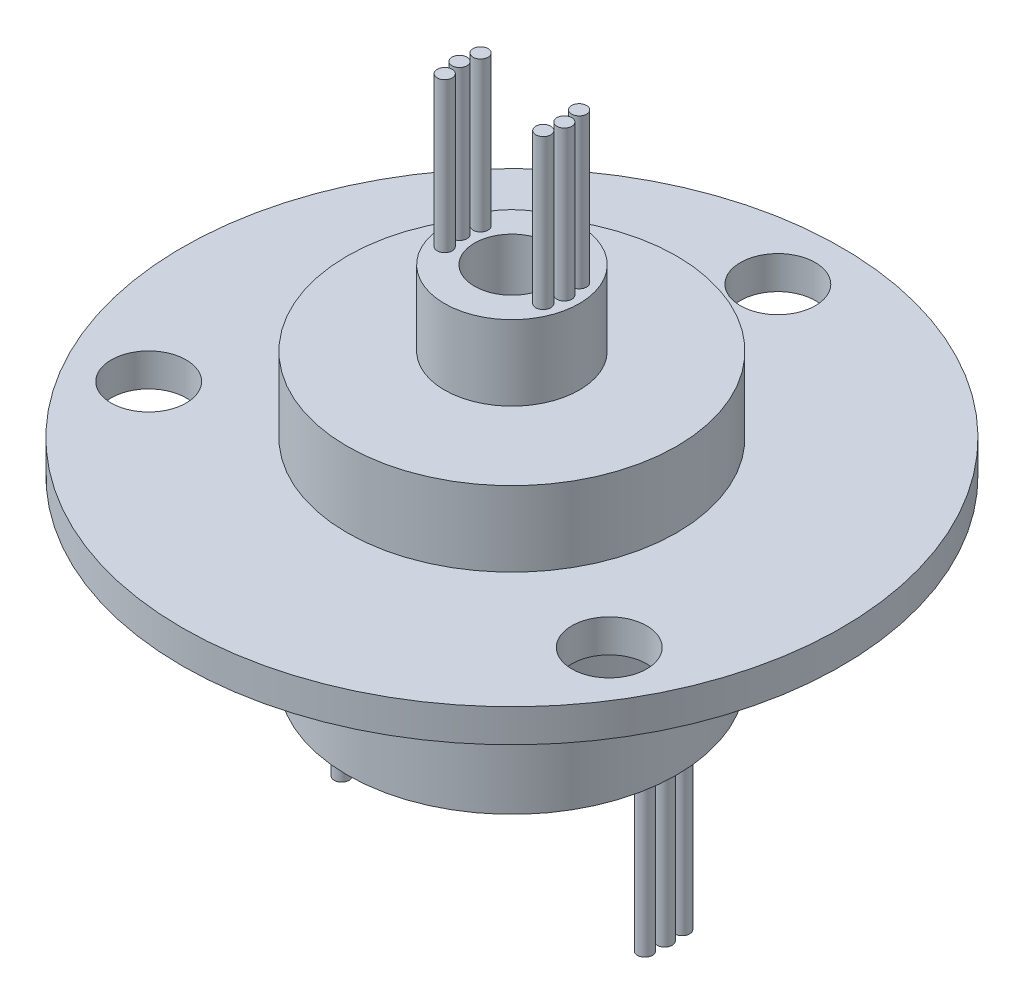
ISO-10303-21;
HEADER;
FILE_DESCRIPTION(('STEP AP214'),'2;1');
FILE_NAME('part.step','',(''),(''),'','','');
FILE_SCHEMA(('AUTOMOTIVE_DESIGN { 1 0 10303 214 1 1 1 1 }'));
ENDSEC;
DATA;
#1=APPLICATION_CONTEXT('core data for automotive mechanical design processes');
#2=APPLICATION_PROTOCOL_DEFINITION('international standard','automotive_design',2000,#1);
#3=PRODUCT_CONTEXT('',#1,'mechanical');
#4=PRODUCT('Part','Part','',(#3));
#5=PRODUCT_RELATED_PRODUCT_CATEGORY('part','',(#4));
#6=PRODUCT_DEFINITION_FORMATION('','',#4);
#7=PRODUCT_DEFINITION_CONTEXT('part definition',#1,'design');
#8=PRODUCT_DEFINITION('design','',#6,#7);
#9=PRODUCT_DEFINITION_SHAPE('','',#8);
#10=(LENGTH_UNIT() NAMED_UNIT(*) SI_UNIT(.MILLI.,.METRE.));
#11=(NAMED_UNIT(*) PLANE_ANGLE_UNIT() SI_UNIT($,.RADIAN.));
#12=(NAMED_UNIT(*) SI_UNIT($,.STERADIAN.) SOLID_ANGLE_UNIT());
#13=UNCERTAINTY_MEASURE_WITH_UNIT(LENGTH_MEASURE(1.E-05),#10,'distance_accuracy_value','');
#14=(GEOMETRIC_REPRESENTATION_CONTEXT(3) GLOBAL_UNCERTAINTY_ASSIGNED_CONTEXT((#13)) GLOBAL_UNIT_ASSIGNED_CONTEXT((#10,
#11,#12)) REPRESENTATION_CONTEXT('',''));
#15=CARTESIAN_POINT('',(0.,0.,0.));
#16=DIRECTION('',(0.,0.,1.));
#17=DIRECTION('',(1.,0.,0.));
#18=AXIS2_PLACEMENT_3D('',#15,#16,#17);
#19=CARTESIAN_POINT('',(0.,2.2,0.));
#20=DIRECTION('',(0.,1.,0.));
#21=DIRECTION('',(0.,0.,1.));
#22=AXIS2_PLACEMENT_3D('',#19,#20,#21);
#23=PLANE('',#22);
#24=CARTESIAN_POINT('',(0.,2.2,0.));
#25=DIRECTION('',(0.,1.,0.));
#26=DIRECTION('',(0.,0.,1.));
#27=AXIS2_PLACEMENT_3D('',#24,#25,#26);
#28=CIRCLE('',#27,11.);
#29=CARTESIAN_POINT('',(0.,2.2,11.));
#30=VERTEX_POINT('',#29);
#31=EDGE_CURVE('E50',#30,#30,#28,.T.);
#32=ORIENTED_EDGE('',*,*,#31,.F.);
#33=EDGE_LOOP('',(#32));
#34=FACE_BOUND('',#33,.T.);
#35=CARTESIAN_POINT('',(15.3719509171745,2.2,8.87499999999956));
#36=DIRECTION('',(0.,1.,0.));
#37=DIRECTION('',(0.,0.,1.));
#38=AXIS2_PLACEMENT_3D('',#35,#36,#37);
#39=CIRCLE('',#38,2.50000000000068);
#40=CARTESIAN_POINT('',(15.3719509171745,2.2,11.3750000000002));
#41=VERTEX_POINT('',#40);
#42=EDGE_CURVE('E72',#41,#41,#39,.T.);
#43=ORIENTED_EDGE('',*,*,#42,.F.);
#44=EDGE_LOOP('',(#43));
#45=FACE_BOUND('',#44,.T.);
#46=CARTESIAN_POINT('',(0.,2.2,0.));
#47=DIRECTION('',(0.,1.,0.));
#48=DIRECTION('',(0.,0.,1.));
#49=AXIS2_PLACEMENT_3D('',#46,#47,#48);
#50=CIRCLE('',#49,22.);
#51=CARTESIAN_POINT('',(0.,2.2,22.));
#52=VERTEX_POINT('',#51);
#53=EDGE_CURVE('E65',#52,#52,#50,.T.);
#54=ORIENTED_EDGE('',*,*,#53,.T.);
#55=EDGE_LOOP('',(#54));
#56=FACE_BOUND('',#55,.T.);
#57=CARTESIAN_POINT('',(0.,2.2,-17.75));
#58=DIRECTION('',(0.,1.,0.));
#59=DIRECTION('',(0.,0.,1.));
#60=AXIS2_PLACEMENT_3D('',#57,#58,#59);
#61=CIRCLE('',#60,2.5);
#62=CARTESIAN_POINT('',(0.,2.2,-15.25));
#63=VERTEX_POINT('',#62);
#64=EDGE_CURVE('E78',#63,#63,#61,.T.);
#65=ORIENTED_EDGE('',*,*,#64,.F.);
#66=EDGE_LOOP('',(#65));
#67=FACE_BOUND('',#66,.T.);
#68=CARTESIAN_POINT('',(-15.371950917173,2.2,8.87500000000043));
#69=DIRECTION('',(0.,1.,0.));
#70=DIRECTION('',(0.,0.,1.));
#71=AXIS2_PLACEMENT_3D('',#68,#69,#70);
#72=CIRCLE('',#71,2.500000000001);
#73=CARTESIAN_POINT('',(-15.371950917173,2.2,11.3750000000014));
#74=VERTEX_POINT('',#73);
#75=EDGE_CURVE('E66',#74,#74,#72,.T.);
#76=ORIENTED_EDGE('',*,*,#75,.F.);
#77=EDGE_LOOP('',(#76));
#78=FACE_BOUND('',#77,.T.);
#79=ADVANCED_FACE('F37',(#34,#45,#56,#67,#78),#23,.T.);
#80=CARTESIAN_POINT('',(0.,0.,0.));
#81=DIRECTION('',(0.,1.,0.));
#82=DIRECTION('',(0.,0.,1.));
#83=AXIS2_PLACEMENT_3D('',#80,#81,#82);
#84=PLANE('',#83);
#85=CARTESIAN_POINT('',(0.,0.,0.));
#86=DIRECTION('',(0.,-1.,0.));
#87=DIRECTION('',(0.,0.,-1.));
#88=AXIS2_PLACEMENT_3D('',#85,#86,#87);
#89=CIRCLE('',#88,11.);
#90=CARTESIAN_POINT('',(0.,0.,-11.));
#91=VERTEX_POINT('',#90);
#92=EDGE_CURVE('E10',#91,#91,#89,.T.);
#93=ORIENTED_EDGE('',*,*,#92,.F.);
#94=EDGE_LOOP('',(#93));
#95=FACE_BOUND('',#94,.T.);
#96=CARTESIAN_POINT('',(0.,0.,0.));
#97=DIRECTION('',(0.,1.,0.));
#98=DIRECTION('',(0.,0.,1.));
#99=AXIS2_PLACEMENT_3D('',#96,#97,#98);
#100=CIRCLE('',#99,22.);
#101=CARTESIAN_POINT('',(0.,0.,22.));
#102=VERTEX_POINT('',#101);
#103=EDGE_CURVE('E41',#102,#102,#100,.T.);
#104=ORIENTED_EDGE('',*,*,#103,.F.);
#105=EDGE_LOOP('',(#104));
#106=FACE_BOUND('',#105,.T.);
#107=CARTESIAN_POINT('',(0.,0.,-17.75));
#108=DIRECTION('',(0.,1.,0.));
#109=DIRECTION('',(0.,0.,1.));
#110=AXIS2_PLACEMENT_3D('',#107,#108,#109);
#111=CIRCLE('',#110,2.5);
#112=CARTESIAN_POINT('',(0.,0.,-15.25));
#113=VERTEX_POINT('',#112);
#114=EDGE_CURVE('E75',#113,#113,#111,.T.);
#115=ORIENTED_EDGE('',*,*,#114,.T.);
#116=EDGE_LOOP('',(#115));
#117=FACE_BOUND('',#116,.T.);
#118=CARTESIAN_POINT('',(15.3719509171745,0.,8.87499999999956));
#119=DIRECTION('',(0.,1.,0.));
#120=DIRECTION('',(0.,0.,1.));
#121=AXIS2_PLACEMENT_3D('',#118,#119,#120);
#122=CIRCLE('',#121,2.50000000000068);
#123=CARTESIAN_POINT('',(15.3719509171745,0.,11.3750000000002));
#124=VERTEX_POINT('',#123);
#125=EDGE_CURVE('E69',#124,#124,#122,.T.);
#126=ORIENTED_EDGE('',*,*,#125,.T.);
#127=EDGE_LOOP('',(#126));
#128=FACE_BOUND('',#127,.T.);
#129=CARTESIAN_POINT('',(-15.371950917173,0.,8.87500000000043));
#130=DIRECTION('',(0.,1.,0.));
#131=DIRECTION('',(0.,0.,1.));
#132=AXIS2_PLACEMENT_3D('',#129,#130,#131);
#133=CIRCLE('',#132,2.500000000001);
#134=CARTESIAN_POINT('',(-15.371950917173,0.,11.3750000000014));
#135=VERTEX_POINT('',#134);
#136=EDGE_CURVE('E62',#135,#135,#133,.T.);
#137=ORIENTED_EDGE('',*,*,#136,.T.);
#138=EDGE_LOOP('',(#137));
#139=FACE_BOUND('',#138,.T.);
#140=ADVANCED_FACE('F89',(#95,#106,#117,#128,#139),#84,.F.);
#141=CARTESIAN_POINT('',(0.,2.2,0.));
#142=DIRECTION('',(0.,-1.,0.));
#143=DIRECTION('',(0.,0.,-1.));
#144=AXIS2_PLACEMENT_3D('',#141,#142,#143);
#145=CYLINDRICAL_SURFACE('',#144,22.);
#146=ORIENTED_EDGE('',*,*,#53,.F.);
#147=EDGE_LOOP('',(#146));
#148=FACE_BOUND('',#147,.T.);
#149=ORIENTED_EDGE('',*,*,#103,.T.);
#150=EDGE_LOOP('',(#149));
#151=FACE_BOUND('',#150,.T.);
#152=ADVANCED_FACE('F39',(#148,#151),#145,.T.);
#153=CARTESIAN_POINT('',(0.,2.2,-17.75));
#154=DIRECTION('',(0.,-1.,0.));
#155=DIRECTION('',(0.,0.,-1.));
#156=AXIS2_PLACEMENT_3D('',#153,#154,#155);
#157=CYLINDRICAL_SURFACE('',#156,2.5);
#158=ORIENTED_EDGE('',*,*,#64,.T.);
#159=EDGE_LOOP('',(#158));
#160=FACE_BOUND('',#159,.T.);
#161=ORIENTED_EDGE('',*,*,#114,.F.);
#162=EDGE_LOOP('',(#161));
#163=FACE_BOUND('',#162,.T.);
#164=ADVANCED_FACE('F113',(#160,#163),#157,.F.);
#165=CARTESIAN_POINT('',(15.3719509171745,2.2,8.87499999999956));
#166=DIRECTION('',(0.,-1.,0.));
#167=DIRECTION('',(0.,0.,-1.));
#168=AXIS2_PLACEMENT_3D('',#165,#166,#167);
#169=CYLINDRICAL_SURFACE('',#168,2.50000000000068);
#170=ORIENTED_EDGE('',*,*,#42,.T.);
#171=EDGE_LOOP('',(#170));
#172=FACE_BOUND('',#171,.T.);
#173=ORIENTED_EDGE('',*,*,#125,.F.);
#174=EDGE_LOOP('',(#173));
#175=FACE_BOUND('',#174,.T.);
#176=ADVANCED_FACE('F102',(#172,#175),#169,.F.);
#177=CARTESIAN_POINT('',(-15.371950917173,2.2,8.87500000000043));
#178=DIRECTION('',(0.,-1.,0.));
#179=DIRECTION('',(0.,0.,-1.));
#180=AXIS2_PLACEMENT_3D('',#177,#178,#179);
#181=CYLINDRICAL_SURFACE('',#180,2.500000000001);
#182=ORIENTED_EDGE('',*,*,#75,.T.);
#183=EDGE_LOOP('',(#182));
#184=FACE_BOUND('',#183,.T.);
#185=ORIENTED_EDGE('',*,*,#136,.F.);
#186=EDGE_LOOP('',(#185));
#187=FACE_BOUND('',#186,.T.);
#188=ADVANCED_FACE('F99',(#184,#187),#181,.F.);
#189=CARTESIAN_POINT('',(0.,7.2,0.));
#190=DIRECTION('',(0.,-1.,0.));
#191=DIRECTION('',(0.,0.,-1.));
#192=AXIS2_PLACEMENT_3D('',#189,#190,#191);
#193=CYLINDRICAL_SURFACE('',#192,11.);
#194=CARTESIAN_POINT('',(0.,7.2,0.));
#195=DIRECTION('',(0.,1.,0.));
#196=DIRECTION('',(0.,0.,1.));
#197=AXIS2_PLACEMENT_3D('',#194,#195,#196);
#198=CIRCLE('',#197,11.);
#199=CARTESIAN_POINT('',(0.,7.2,11.));
#200=VERTEX_POINT('',#199);
#201=EDGE_CURVE('E58',#200,#200,#198,.T.);
#202=ORIENTED_EDGE('',*,*,#201,.F.);
#203=EDGE_LOOP('',(#202));
#204=FACE_BOUND('',#203,.T.);
#205=ORIENTED_EDGE('',*,*,#31,.T.);
#206=EDGE_LOOP('',(#205));
#207=FACE_BOUND('',#206,.T.);
#208=ADVANCED_FACE('F101',(#204,#207),#193,.T.);
#209=CARTESIAN_POINT('',(0.,7.2,0.));
#210=DIRECTION('',(0.,1.,0.));
#211=DIRECTION('',(0.,0.,1.));
#212=AXIS2_PLACEMENT_3D('',#209,#210,#211);
#213=PLANE('',#212);
#214=CARTESIAN_POINT('',(0.,7.2,0.));
#215=DIRECTION('',(0.,1.,0.));
#216=DIRECTION('',(0.,0.,1.));
#217=AXIS2_PLACEMENT_3D('',#214,#215,#216);
#218=CIRCLE('',#217,4.5);
#219=CARTESIAN_POINT('',(0.,7.2,4.5));
#220=VERTEX_POINT('',#219);
#221=EDGE_CURVE('E45',#220,#220,#218,.T.);
#222=ORIENTED_EDGE('',*,*,#221,.F.);
#223=EDGE_LOOP('',(#222));
#224=FACE_BOUND('',#223,.T.);
#225=ORIENTED_EDGE('',*,*,#201,.T.);
#226=EDGE_LOOP('',(#225));
#227=FACE_BOUND('',#226,.T.);
#228=ADVANCED_FACE('F110',(#224,#227),#213,.T.);
#229=CARTESIAN_POINT('',(0.,12.2,0.));
#230=DIRECTION('',(0.,-1.,0.));
#231=DIRECTION('',(0.,0.,-1.));
#232=AXIS2_PLACEMENT_3D('',#229,#230,#231);
#233=CYLINDRICAL_SURFACE('',#232,4.5);
#234=CARTESIAN_POINT('',(0.,12.2,0.));
#235=DIRECTION('',(0.,1.,0.));
#236=DIRECTION('',(0.,0.,1.));
#237=AXIS2_PLACEMENT_3D('',#234,#235,#236);
#238=CIRCLE('',#237,4.5);
#239=CARTESIAN_POINT('',(0.,12.2,4.5));
#240=VERTEX_POINT('',#239);
#241=EDGE_CURVE('E56',#240,#240,#238,.T.);
#242=ORIENTED_EDGE('',*,*,#241,.F.);
#243=EDGE_LOOP('',(#242));
#244=FACE_BOUND('',#243,.T.);
#245=ORIENTED_EDGE('',*,*,#221,.T.);
#246=EDGE_LOOP('',(#245));
#247=FACE_BOUND('',#246,.T.);
#248=ADVANCED_FACE('F170',(#244,#247),#233,.T.);
#249=CARTESIAN_POINT('',(0.,12.2,0.));
#250=DIRECTION('',(0.,1.,0.));
#251=DIRECTION('',(0.,0.,1.));
#252=AXIS2_PLACEMENT_3D('',#249,#250,#251);
#253=PLANE('',#252);
#254=CARTESIAN_POINT('',(3.28892417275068,12.2,-1.19707050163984));
#255=DIRECTION('',(0.,1.,0.));
#256=DIRECTION('',(0.,0.,-1.));
#257=AXIS2_PLACEMENT_3D('',#254,#255,#256);
#258=CIRCLE('',#257,0.5);
#259=CARTESIAN_POINT('',(3.28892417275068,12.2,-1.69707050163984));
#260=VERTEX_POINT('',#259);
#261=EDGE_CURVE('E502',#260,#260,#258,.T.);
#262=ORIENTED_EDGE('',*,*,#261,.F.);
#263=EDGE_LOOP('',(#262));
#264=FACE_BOUND('',#263,.T.);
#265=CARTESIAN_POINT('',(3.5,12.2,0.));
#266=DIRECTION('',(0.,1.,0.));
#267=DIRECTION('',(0.,0.,-1.));
#268=AXIS2_PLACEMENT_3D('',#265,#266,#267);
#269=CIRCLE('',#268,0.5);
#270=CARTESIAN_POINT('',(3.5,12.2,-0.5));
#271=VERTEX_POINT('',#270);
#272=EDGE_CURVE('E508',#271,#271,#269,.T.);
#273=ORIENTED_EDGE('',*,*,#272,.F.);
#274=EDGE_LOOP('',(#273));
#275=FACE_BOUND('',#274,.T.);
#276=CARTESIAN_POINT('',(3.28892417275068,12.2,1.19707050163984));
#277=DIRECTION('',(0.,1.,0.));
#278=DIRECTION('',(0.,0.,1.));
#279=AXIS2_PLACEMENT_3D('',#276,#277,#278);
#280=CIRCLE('',#279,0.5);
#281=CARTESIAN_POINT('',(3.28892417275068,12.2,1.69707050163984));
#282=VERTEX_POINT('',#281);
#283=EDGE_CURVE('E514',#282,#282,#280,.T.);
#284=ORIENTED_EDGE('',*,*,#283,.F.);
#285=EDGE_LOOP('',(#284));
#286=FACE_BOUND('',#285,.T.);
#287=CARTESIAN_POINT('',(-3.28892417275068,12.2,-1.19707050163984));
#288=DIRECTION('',(0.,1.,0.));
#289=DIRECTION('',(0.,0.,1.));
#290=AXIS2_PLACEMENT_3D('',#287,#288,#289);
#291=CIRCLE('',#290,0.5);
#292=CARTESIAN_POINT('',(-3.28892417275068,12.2,-0.697070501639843));
#293=VERTEX_POINT('',#292);
#294=EDGE_CURVE('E520',#293,#293,#291,.T.);
#295=ORIENTED_EDGE('',*,*,#294,.F.);
#296=EDGE_LOOP('',(#295));
#297=FACE_BOUND('',#296,.T.);
#298=CARTESIAN_POINT('',(-3.5,12.2,0.));
#299=DIRECTION('',(0.,1.,0.));
#300=DIRECTION('',(0.,0.,1.));
#301=AXIS2_PLACEMENT_3D('',#298,#299,#300);
#302=CIRCLE('',#301,0.5);
#303=CARTESIAN_POINT('',(-3.5,12.2,0.5));
#304=VERTEX_POINT('',#303);
#305=EDGE_CURVE('E526',#304,#304,#302,.T.);
#306=ORIENTED_EDGE('',*,*,#305,.F.);
#307=EDGE_LOOP('',(#306));
#308=FACE_BOUND('',#307,.T.);
#309=CARTESIAN_POINT('',(-3.28892417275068,12.2,1.19707050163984));
#310=DIRECTION('',(0.,1.,0.));
#311=DIRECTION('',(0.,0.,-1.));
#312=AXIS2_PLACEMENT_3D('',#309,#310,#311);
#313=CIRCLE('',#312,0.5);
#314=CARTESIAN_POINT('',(-3.28892417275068,12.2,0.697070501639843));
#315=VERTEX_POINT('',#314);
#316=EDGE_CURVE('E529',#315,#315,#313,.T.);
#317=ORIENTED_EDGE('',*,*,#316,.F.);
#318=EDGE_LOOP('',(#317));
#319=FACE_BOUND('',#318,.T.);
#320=CARTESIAN_POINT('',(0.,12.2,0.));
#321=DIRECTION('',(0.,1.,0.));
#322=DIRECTION('',(0.,0.,1.));
#323=AXIS2_PLACEMENT_3D('',#320,#321,#322);
#324=CIRCLE('',#323,2.5);
#325=CARTESIAN_POINT('',(0.,12.2,2.5));
#326=VERTEX_POINT('',#325);
#327=EDGE_CURVE('E535',#326,#326,#324,.T.);
#328=ORIENTED_EDGE('',*,*,#327,.F.);
#329=EDGE_LOOP('',(#328));
#330=FACE_BOUND('',#329,.T.);
#331=ORIENTED_EDGE('',*,*,#241,.T.);
#332=EDGE_LOOP('',(#331));
#333=FACE_BOUND('',#332,.T.);
#334=ADVANCED_FACE('F180',(#264,#275,#286,#297,#308,#319,#330,#333),#253,.T.);
#335=CARTESIAN_POINT('',(0.,-11.8,0.));
#336=DIRECTION('',(0.,1.,0.));
#337=DIRECTION('',(0.,0.,1.));
#338=AXIS2_PLACEMENT_3D('',#335,#336,#337);
#339=CYLINDRICAL_SURFACE('',#338,11.);
#340=CARTESIAN_POINT('',(0.,-11.8,0.));
#341=DIRECTION('',(0.,-1.,0.));
#342=DIRECTION('',(0.,0.,-1.));
#343=AXIS2_PLACEMENT_3D('',#340,#341,#342);
#344=CIRCLE('',#343,11.);
#345=CARTESIAN_POINT('',(0.,-11.8,-11.));
#346=VERTEX_POINT('',#345);
#347=EDGE_CURVE('E54',#346,#346,#344,.T.);
#348=ORIENTED_EDGE('',*,*,#347,.F.);
#349=EDGE_LOOP('',(#348));
#350=FACE_BOUND('',#349,.T.);
#351=ORIENTED_EDGE('',*,*,#92,.T.);
#352=EDGE_LOOP('',(#351));
#353=FACE_BOUND('',#352,.T.);
#354=ADVANCED_FACE('F190',(#350,#353),#339,.T.);
#355=CARTESIAN_POINT('',(0.,-11.8,0.));
#356=DIRECTION('',(0.,-1.,0.));
#357=DIRECTION('',(0.,0.,-1.));
#358=AXIS2_PLACEMENT_3D('',#355,#356,#357);
#359=PLANE('',#358);
#360=CARTESIAN_POINT('',(10.1226932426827,-11.8,1.2429104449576));
#361=DIRECTION('',(0.,-1.,0.));
#362=DIRECTION('',(0.,0.,1.));
#363=AXIS2_PLACEMENT_3D('',#360,#361,#362);
#364=CIRCLE('',#363,0.5);
#365=CARTESIAN_POINT('',(10.1226932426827,-11.8,1.7429104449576));
#366=VERTEX_POINT('',#365);
#367=EDGE_CURVE('E466',#366,#366,#364,.T.);
#368=ORIENTED_EDGE('',*,*,#367,.F.);
#369=EDGE_LOOP('',(#368));
#370=FACE_BOUND('',#369,.T.);
#371=CARTESIAN_POINT('',(10.1987129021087,-11.8,0.));
#372=DIRECTION('',(0.,-1.,0.));
#373=DIRECTION('',(0.,0.,1.));
#374=AXIS2_PLACEMENT_3D('',#371,#372,#373);
#375=CIRCLE('',#374,0.500000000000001);
#376=CARTESIAN_POINT('',(10.1987129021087,-11.8,0.500000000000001));
#377=VERTEX_POINT('',#376);
#378=EDGE_CURVE('E472',#377,#377,#375,.T.);
#379=ORIENTED_EDGE('',*,*,#378,.F.);
#380=EDGE_LOOP('',(#379));
#381=FACE_BOUND('',#380,.T.);
#382=CARTESIAN_POINT('',(10.1226932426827,-11.8,-1.2429104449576));
#383=DIRECTION('',(0.,-1.,0.));
#384=DIRECTION('',(0.,0.,-1.));
#385=AXIS2_PLACEMENT_3D('',#382,#383,#384);
#386=CIRCLE('',#385,0.5);
#387=CARTESIAN_POINT('',(10.1226932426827,-11.8,-1.7429104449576));
#388=VERTEX_POINT('',#387);
#389=EDGE_CURVE('E478',#388,#388,#386,.T.);
#390=ORIENTED_EDGE('',*,*,#389,.F.);
#391=EDGE_LOOP('',(#390));
#392=FACE_BOUND('',#391,.T.);
#393=CARTESIAN_POINT('',(-10.1226932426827,-11.8,1.2429104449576));
#394=DIRECTION('',(0.,-1.,0.));
#395=DIRECTION('',(0.,0.,-1.));
#396=AXIS2_PLACEMENT_3D('',#393,#394,#395);
#397=CIRCLE('',#396,0.5);
#398=CARTESIAN_POINT('',(-10.1226932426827,-11.8,0.742910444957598));
#399=VERTEX_POINT('',#398);
#400=EDGE_CURVE('E484',#399,#399,#397,.T.);
#401=ORIENTED_EDGE('',*,*,#400,.F.);
#402=EDGE_LOOP('',(#401));
#403=FACE_BOUND('',#402,.T.);
#404=CARTESIAN_POINT('',(-10.1226932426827,-11.8,-1.2429104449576));
#405=DIRECTION('',(0.,-1.,0.));
#406=DIRECTION('',(0.,0.,1.));
#407=AXIS2_PLACEMENT_3D('',#404,#405,#406);
#408=CIRCLE('',#407,0.5);
#409=CARTESIAN_POINT('',(-10.1226932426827,-11.8,-0.742910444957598));
#410=VERTEX_POINT('',#409);
#411=EDGE_CURVE('E490',#410,#410,#408,.T.);
#412=ORIENTED_EDGE('',*,*,#411,.F.);
#413=EDGE_LOOP('',(#412));
#414=FACE_BOUND('',#413,.T.);
#415=CARTESIAN_POINT('',(-10.1987129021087,-11.8,0.));
#416=DIRECTION('',(0.,-1.,0.));
#417=DIRECTION('',(0.,0.,-1.));
#418=AXIS2_PLACEMENT_3D('',#415,#416,#417);
#419=CIRCLE('',#418,0.500000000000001);
#420=CARTESIAN_POINT('',(-10.1987129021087,-11.8,-0.500000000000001));
#421=VERTEX_POINT('',#420);
#422=EDGE_CURVE('E493',#421,#421,#419,.T.);
#423=ORIENTED_EDGE('',*,*,#422,.F.);
#424=EDGE_LOOP('',(#423));
#425=FACE_BOUND('',#424,.T.);
#426=CARTESIAN_POINT('',(0.,-11.8,0.));
#427=DIRECTION('',(0.,1.,0.));
#428=DIRECTION('',(0.,0.,1.));
#429=AXIS2_PLACEMENT_3D('',#426,#427,#428);
#430=CIRCLE('',#429,2.5);
#431=CARTESIAN_POINT('',(0.,-11.8,2.5));
#432=VERTEX_POINT('',#431);
#433=EDGE_CURVE('E538',#432,#432,#430,.T.);
#434=ORIENTED_EDGE('',*,*,#433,.T.);
#435=EDGE_LOOP('',(#434));
#436=FACE_BOUND('',#435,.T.);
#437=ORIENTED_EDGE('',*,*,#347,.T.);
#438=EDGE_LOOP('',(#437));
#439=FACE_BOUND('',#438,.T.);
#440=ADVANCED_FACE('F202',(#370,#381,#392,#403,#414,#425,#436,#439),#359,.T.);
#441=CARTESIAN_POINT('',(0.,-11.8,0.));
#442=DIRECTION('',(0.,1.,0.));
#443=DIRECTION('',(0.,0.,1.));
#444=AXIS2_PLACEMENT_3D('',#441,#442,#443);
#445=CYLINDRICAL_SURFACE('',#444,2.5);
#446=ORIENTED_EDGE('',*,*,#433,.F.);
#447=EDGE_LOOP('',(#446));
#448=FACE_BOUND('',#447,.T.);
#449=ORIENTED_EDGE('',*,*,#327,.T.);
#450=EDGE_LOOP('',(#449));
#451=FACE_BOUND('',#450,.T.);
#452=ADVANCED_FACE('F212',(#448,#451),#445,.F.);
#453=CARTESIAN_POINT('',(-3.28892417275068,22.2,1.19707050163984));
#454=DIRECTION('',(0.,-1.,0.));
#455=DIRECTION('',(0.,0.,-1.));
#456=AXIS2_PLACEMENT_3D('',#453,#454,#455);
#457=CYLINDRICAL_SURFACE('',#456,0.5);
#458=CARTESIAN_POINT('',(-3.28892417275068,22.2,1.19707050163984));
#459=DIRECTION('',(0.,1.,0.));
#460=DIRECTION('',(0.,0.,-1.));
#461=AXIS2_PLACEMENT_3D('',#458,#459,#460);
#462=CIRCLE('',#461,0.5);
#463=CARTESIAN_POINT('',(-3.28892417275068,22.2,0.697070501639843));
#464=VERTEX_POINT('',#463);
#465=EDGE_CURVE('E532',#464,#464,#462,.T.);
#466=ORIENTED_EDGE('',*,*,#465,.F.);
#467=EDGE_LOOP('',(#466));
#468=FACE_BOUND('',#467,.T.);
#469=ORIENTED_EDGE('',*,*,#316,.T.);
#470=EDGE_LOOP('',(#469));
#471=FACE_BOUND('',#470,.T.);
#472=ADVANCED_FACE('F223',(#468,#471),#457,.T.);
#473=CARTESIAN_POINT('',(-3.28892417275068,22.2,1.19707050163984));
#474=DIRECTION('',(0.,-1.,0.));
#475=DIRECTION('',(0.,0.,-1.));
#476=AXIS2_PLACEMENT_3D('',#473,#474,#475);
#477=PLANE('',#476);
#478=ORIENTED_EDGE('',*,*,#465,.T.);
#479=EDGE_LOOP('',(#478));
#480=FACE_BOUND('',#479,.T.);
#481=ADVANCED_FACE('F232',(#480),#477,.F.);
#482=CARTESIAN_POINT('',(-3.5,22.2,0.));
#483=DIRECTION('',(0.,-1.,0.));
#484=DIRECTION('',(0.,0.,-1.));
#485=AXIS2_PLACEMENT_3D('',#482,#483,#484);
#486=CYLINDRICAL_SURFACE('',#485,0.5);
#487=CARTESIAN_POINT('',(-3.5,22.2,0.));
#488=DIRECTION('',(0.,1.,0.));
#489=DIRECTION('',(0.,0.,1.));
#490=AXIS2_PLACEMENT_3D('',#487,#488,#489);
#491=CIRCLE('',#490,0.5);
#492=CARTESIAN_POINT('',(-3.5,22.2,0.5));
#493=VERTEX_POINT('',#492);
#494=EDGE_CURVE('E523',#493,#493,#491,.T.);
#495=ORIENTED_EDGE('',*,*,#494,.F.);
#496=EDGE_LOOP('',(#495));
#497=FACE_BOUND('',#496,.T.);
#498=ORIENTED_EDGE('',*,*,#305,.T.);
#499=EDGE_LOOP('',(#498));
#500=FACE_BOUND('',#499,.T.);
#501=ADVANCED_FACE('F242',(#497,#500),#486,.T.);
#502=CARTESIAN_POINT('',(-3.5,22.2,0.));
#503=DIRECTION('',(0.,1.,0.));
#504=DIRECTION('',(0.,0.,1.));
#505=AXIS2_PLACEMENT_3D('',#502,#503,#504);
#506=PLANE('',#505);
#507=ORIENTED_EDGE('',*,*,#494,.T.);
#508=EDGE_LOOP('',(#507));
#509=FACE_BOUND('',#508,.T.);
#510=ADVANCED_FACE('F252',(#509),#506,.T.);
#511=CARTESIAN_POINT('',(-3.28892417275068,22.2,-1.19707050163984));
#512=DIRECTION('',(0.,-1.,0.));
#513=DIRECTION('',(0.,0.,-1.));
#514=AXIS2_PLACEMENT_3D('',#511,#512,#513);
#515=CYLINDRICAL_SURFACE('',#514,0.5);
#516=CARTESIAN_POINT('',(-3.28892417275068,22.2,-1.19707050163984));
#517=DIRECTION('',(0.,1.,0.));
#518=DIRECTION('',(0.,0.,1.));
#519=AXIS2_PLACEMENT_3D('',#516,#517,#518);
#520=CIRCLE('',#519,0.5);
#521=CARTESIAN_POINT('',(-3.28892417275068,22.2,-0.697070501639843));
#522=VERTEX_POINT('',#521);
#523=EDGE_CURVE('E517',#522,#522,#520,.T.);
#524=ORIENTED_EDGE('',*,*,#523,.F.);
#525=EDGE_LOOP('',(#524));
#526=FACE_BOUND('',#525,.T.);
#527=ORIENTED_EDGE('',*,*,#294,.T.);
#528=EDGE_LOOP('',(#527));
#529=FACE_BOUND('',#528,.T.);
#530=ADVANCED_FACE('F262',(#526,#529),#515,.T.);
#531=CARTESIAN_POINT('',(-3.28892417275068,22.2,-1.19707050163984));
#532=DIRECTION('',(0.,1.,0.));
#533=DIRECTION('',(0.,0.,1.));
#534=AXIS2_PLACEMENT_3D('',#531,#532,#533);
#535=PLANE('',#534);
#536=ORIENTED_EDGE('',*,*,#523,.T.);
#537=EDGE_LOOP('',(#536));
#538=FACE_BOUND('',#537,.T.);
#539=ADVANCED_FACE('F272',(#538),#535,.T.);
#540=CARTESIAN_POINT('',(3.28892417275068,22.2,1.19707050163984));
#541=DIRECTION('',(0.,-1.,0.));
#542=DIRECTION('',(0.,0.,-1.));
#543=AXIS2_PLACEMENT_3D('',#540,#541,#542);
#544=CYLINDRICAL_SURFACE('',#543,0.5);
#545=CARTESIAN_POINT('',(3.28892417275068,22.2,1.19707050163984));
#546=DIRECTION('',(0.,1.,0.));
#547=DIRECTION('',(0.,0.,1.));
#548=AXIS2_PLACEMENT_3D('',#545,#546,#547);
#549=CIRCLE('',#548,0.5);
#550=CARTESIAN_POINT('',(3.28892417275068,22.2,1.69707050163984));
#551=VERTEX_POINT('',#550);
#552=EDGE_CURVE('E511',#551,#551,#549,.T.);
#553=ORIENTED_EDGE('',*,*,#552,.F.);
#554=EDGE_LOOP('',(#553));
#555=FACE_BOUND('',#554,.T.);
#556=ORIENTED_EDGE('',*,*,#283,.T.);
#557=EDGE_LOOP('',(#556));
#558=FACE_BOUND('',#557,.T.);
#559=ADVANCED_FACE('F282',(#555,#558),#544,.T.);
#560=CARTESIAN_POINT('',(3.28892417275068,22.2,1.19707050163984));
#561=DIRECTION('',(0.,1.,0.));
#562=DIRECTION('',(0.,0.,1.));
#563=AXIS2_PLACEMENT_3D('',#560,#561,#562);
#564=PLANE('',#563);
#565=ORIENTED_EDGE('',*,*,#552,.T.);
#566=EDGE_LOOP('',(#565));
#567=FACE_BOUND('',#566,.T.);
#568=ADVANCED_FACE('F292',(#567),#564,.T.);
#569=CARTESIAN_POINT('',(3.5,22.2,0.));
#570=DIRECTION('',(0.,-1.,0.));
#571=DIRECTION('',(0.,0.,-1.));
#572=AXIS2_PLACEMENT_3D('',#569,#570,#571);
#573=CYLINDRICAL_SURFACE('',#572,0.5);
#574=CARTESIAN_POINT('',(3.5,22.2,0.));
#575=DIRECTION('',(0.,1.,0.));
#576=DIRECTION('',(0.,0.,-1.));
#577=AXIS2_PLACEMENT_3D('',#574,#575,#576);
#578=CIRCLE('',#577,0.5);
#579=CARTESIAN_POINT('',(3.5,22.2,-0.5));
#580=VERTEX_POINT('',#579);
#581=EDGE_CURVE('E505',#580,#580,#578,.T.);
#582=ORIENTED_EDGE('',*,*,#581,.F.);
#583=EDGE_LOOP('',(#582));
#584=FACE_BOUND('',#583,.T.);
#585=ORIENTED_EDGE('',*,*,#272,.T.);
#586=EDGE_LOOP('',(#585));
#587=FACE_BOUND('',#586,.T.);
#588=ADVANCED_FACE('F302',(#584,#587),#573,.T.);
#589=CARTESIAN_POINT('',(3.5,22.2,0.));
#590=DIRECTION('',(0.,-1.,0.));
#591=DIRECTION('',(0.,0.,-1.));
#592=AXIS2_PLACEMENT_3D('',#589,#590,#591);
#593=PLANE('',#592);
#594=ORIENTED_EDGE('',*,*,#581,.T.);
#595=EDGE_LOOP('',(#594));
#596=FACE_BOUND('',#595,.T.);
#597=ADVANCED_FACE('F312',(#596),#593,.F.);
#598=CARTESIAN_POINT('',(3.28892417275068,22.2,-1.19707050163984));
#599=DIRECTION('',(0.,-1.,0.));
#600=DIRECTION('',(0.,0.,-1.));
#601=AXIS2_PLACEMENT_3D('',#598,#599,#600);
#602=CYLINDRICAL_SURFACE('',#601,0.5);
#603=CARTESIAN_POINT('',(3.28892417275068,22.2,-1.19707050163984));
#604=DIRECTION('',(0.,1.,0.));
#605=DIRECTION('',(0.,0.,-1.));
#606=AXIS2_PLACEMENT_3D('',#603,#604,#605);
#607=CIRCLE('',#606,0.5);
#608=CARTESIAN_POINT('',(3.28892417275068,22.2,-1.69707050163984));
#609=VERTEX_POINT('',#608);
#610=EDGE_CURVE('E499',#609,#609,#607,.T.);
#611=ORIENTED_EDGE('',*,*,#610,.F.);
#612=EDGE_LOOP('',(#611));
#613=FACE_BOUND('',#612,.T.);
#614=ORIENTED_EDGE('',*,*,#261,.T.);
#615=EDGE_LOOP('',(#614));
#616=FACE_BOUND('',#615,.T.);
#617=ADVANCED_FACE('F322',(#613,#616),#602,.T.);
#618=CARTESIAN_POINT('',(3.28892417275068,22.2,-1.19707050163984));
#619=DIRECTION('',(0.,-1.,0.));
#620=DIRECTION('',(0.,0.,-1.));
#621=AXIS2_PLACEMENT_3D('',#618,#619,#620);
#622=PLANE('',#621);
#623=ORIENTED_EDGE('',*,*,#610,.T.);
#624=EDGE_LOOP('',(#623));
#625=FACE_BOUND('',#624,.T.);
#626=ADVANCED_FACE('F332',(#625),#622,.F.);
#627=CARTESIAN_POINT('',(-10.1987129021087,-21.8,0.));
#628=DIRECTION('',(0.,1.,0.));
#629=DIRECTION('',(0.,0.,1.));
#630=AXIS2_PLACEMENT_3D('',#627,#628,#629);
#631=CYLINDRICAL_SURFACE('',#630,0.500000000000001);
#632=CARTESIAN_POINT('',(-10.1987129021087,-21.8,0.));
#633=DIRECTION('',(0.,-1.,0.));
#634=DIRECTION('',(0.,0.,-1.));
#635=AXIS2_PLACEMENT_3D('',#632,#633,#634);
#636=CIRCLE('',#635,0.500000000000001);
#637=CARTESIAN_POINT('',(-10.1987129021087,-21.8,-0.500000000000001));
#638=VERTEX_POINT('',#637);
#639=EDGE_CURVE('E496',#638,#638,#636,.T.);
#640=ORIENTED_EDGE('',*,*,#639,.F.);
#641=EDGE_LOOP('',(#640));
#642=FACE_BOUND('',#641,.T.);
#643=ORIENTED_EDGE('',*,*,#422,.T.);
#644=EDGE_LOOP('',(#643));
#645=FACE_BOUND('',#644,.T.);
#646=ADVANCED_FACE('F341',(#642,#645),#631,.T.);
#647=CARTESIAN_POINT('',(-10.1987129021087,-21.8,0.));
#648=DIRECTION('',(0.,-1.,0.));
#649=DIRECTION('',(0.,0.,-1.));
#650=AXIS2_PLACEMENT_3D('',#647,#648,#649);
#651=PLANE('',#650);
#652=ORIENTED_EDGE('',*,*,#639,.T.);
#653=EDGE_LOOP('',(#652));
#654=FACE_BOUND('',#653,.T.);
#655=ADVANCED_FACE('F350',(#654),#651,.T.);
#656=CARTESIAN_POINT('',(-10.1226932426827,-21.8,-1.2429104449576));
#657=DIRECTION('',(0.,1.,0.));
#658=DIRECTION('',(0.,0.,1.));
#659=AXIS2_PLACEMENT_3D('',#656,#657,#658);
#660=CYLINDRICAL_SURFACE('',#659,0.5);
#661=CARTESIAN_POINT('',(-10.1226932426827,-21.8,-1.2429104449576));
#662=DIRECTION('',(0.,-1.,0.));
#663=DIRECTION('',(0.,0.,1.));
#664=AXIS2_PLACEMENT_3D('',#661,#662,#663);
#665=CIRCLE('',#664,0.5);
#666=CARTESIAN_POINT('',(-10.1226932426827,-21.8,-0.742910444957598));
#667=VERTEX_POINT('',#666);
#668=EDGE_CURVE('E487',#667,#667,#665,.T.);
#669=ORIENTED_EDGE('',*,*,#668,.F.);
#670=EDGE_LOOP('',(#669));
#671=FACE_BOUND('',#670,.T.);
#672=ORIENTED_EDGE('',*,*,#411,.T.);
#673=EDGE_LOOP('',(#672));
#674=FACE_BOUND('',#673,.T.);
#675=ADVANCED_FACE('F360',(#671,#674),#660,.T.);
#676=CARTESIAN_POINT('',(-10.1226932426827,-21.8,-1.2429104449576));
#677=DIRECTION('',(0.,1.,0.));
#678=DIRECTION('',(0.,0.,1.));
#679=AXIS2_PLACEMENT_3D('',#676,#677,#678);
#680=PLANE('',#679);
#681=ORIENTED_EDGE('',*,*,#668,.T.);
#682=EDGE_LOOP('',(#681));
#683=FACE_BOUND('',#682,.T.);
#684=ADVANCED_FACE('F370',(#683),#680,.F.);
#685=CARTESIAN_POINT('',(-10.1226932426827,-21.8,1.2429104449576));
#686=DIRECTION('',(0.,1.,0.));
#687=DIRECTION('',(0.,0.,1.));
#688=AXIS2_PLACEMENT_3D('',#685,#686,#687);
#689=CYLINDRICAL_SURFACE('',#688,0.5);
#690=CARTESIAN_POINT('',(-10.1226932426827,-21.8,1.2429104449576));
#691=DIRECTION('',(0.,-1.,0.));
#692=DIRECTION('',(0.,0.,-1.));
#693=AXIS2_PLACEMENT_3D('',#690,#691,#692);
#694=CIRCLE('',#693,0.5);
#695=CARTESIAN_POINT('',(-10.1226932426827,-21.8,0.742910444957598));
#696=VERTEX_POINT('',#695);
#697=EDGE_CURVE('E481',#696,#696,#694,.T.);
#698=ORIENTED_EDGE('',*,*,#697,.F.);
#699=EDGE_LOOP('',(#698));
#700=FACE_BOUND('',#699,.T.);
#701=ORIENTED_EDGE('',*,*,#400,.T.);
#702=EDGE_LOOP('',(#701));
#703=FACE_BOUND('',#702,.T.);
#704=ADVANCED_FACE('F380',(#700,#703),#689,.T.);
#705=CARTESIAN_POINT('',(-10.1226932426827,-21.8,1.2429104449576));
#706=DIRECTION('',(0.,-1.,0.));
#707=DIRECTION('',(0.,0.,-1.));
#708=AXIS2_PLACEMENT_3D('',#705,#706,#707);
#709=PLANE('',#708);
#710=ORIENTED_EDGE('',*,*,#697,.T.);
#711=EDGE_LOOP('',(#710));
#712=FACE_BOUND('',#711,.T.);
#713=ADVANCED_FACE('F390',(#712),#709,.T.);
#714=CARTESIAN_POINT('',(10.1226932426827,-21.8,-1.2429104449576));
#715=DIRECTION('',(0.,1.,0.));
#716=DIRECTION('',(0.,0.,1.));
#717=AXIS2_PLACEMENT_3D('',#714,#715,#716);
#718=CYLINDRICAL_SURFACE('',#717,0.5);
#719=CARTESIAN_POINT('',(10.1226932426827,-21.8,-1.2429104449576));
#720=DIRECTION('',(0.,-1.,0.));
#721=DIRECTION('',(0.,0.,-1.));
#722=AXIS2_PLACEMENT_3D('',#719,#720,#721);
#723=CIRCLE('',#722,0.5);
#724=CARTESIAN_POINT('',(10.1226932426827,-21.8,-1.7429104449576));
#725=VERTEX_POINT('',#724);
#726=EDGE_CURVE('E475',#725,#725,#723,.T.);
#727=ORIENTED_EDGE('',*,*,#726,.F.);
#728=EDGE_LOOP('',(#727));
#729=FACE_BOUND('',#728,.T.);
#730=ORIENTED_EDGE('',*,*,#389,.T.);
#731=EDGE_LOOP('',(#730));
#732=FACE_BOUND('',#731,.T.);
#733=ADVANCED_FACE('F400',(#729,#732),#718,.T.);
#734=CARTESIAN_POINT('',(10.1226932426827,-21.8,-1.2429104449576));
#735=DIRECTION('',(0.,-1.,0.));
#736=DIRECTION('',(0.,0.,-1.));
#737=AXIS2_PLACEMENT_3D('',#734,#735,#736);
#738=PLANE('',#737);
#739=ORIENTED_EDGE('',*,*,#726,.T.);
#740=EDGE_LOOP('',(#739));
#741=FACE_BOUND('',#740,.T.);
#742=ADVANCED_FACE('F410',(#741),#738,.T.);
#743=CARTESIAN_POINT('',(10.1987129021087,-21.8,0.));
#744=DIRECTION('',(0.,1.,0.));
#745=DIRECTION('',(0.,0.,1.));
#746=AXIS2_PLACEMENT_3D('',#743,#744,#745);
#747=CYLINDRICAL_SURFACE('',#746,0.500000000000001);
#748=CARTESIAN_POINT('',(10.1987129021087,-21.8,0.));
#749=DIRECTION('',(0.,-1.,0.));
#750=DIRECTION('',(0.,0.,1.));
#751=AXIS2_PLACEMENT_3D('',#748,#749,#750);
#752=CIRCLE('',#751,0.500000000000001);
#753=CARTESIAN_POINT('',(10.1987129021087,-21.8,0.500000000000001));
#754=VERTEX_POINT('',#753);
#755=EDGE_CURVE('E469',#754,#754,#752,.T.);
#756=ORIENTED_EDGE('',*,*,#755,.F.);
#757=EDGE_LOOP('',(#756));
#758=FACE_BOUND('',#757,.T.);
#759=ORIENTED_EDGE('',*,*,#378,.T.);
#760=EDGE_LOOP('',(#759));
#761=FACE_BOUND('',#760,.T.);
#762=ADVANCED_FACE('F420',(#758,#761),#747,.T.);
#763=CARTESIAN_POINT('',(10.1987129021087,-21.8,0.));
#764=DIRECTION('',(0.,1.,0.));
#765=DIRECTION('',(0.,0.,1.));
#766=AXIS2_PLACEMENT_3D('',#763,#764,#765);
#767=PLANE('',#766);
#768=ORIENTED_EDGE('',*,*,#755,.T.);
#769=EDGE_LOOP('',(#768));
#770=FACE_BOUND('',#769,.T.);
#771=ADVANCED_FACE('F430',(#770),#767,.F.);
#772=CARTESIAN_POINT('',(10.1226932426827,-21.8,1.2429104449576));
#773=DIRECTION('',(0.,1.,0.));
#774=DIRECTION('',(0.,0.,1.));
#775=AXIS2_PLACEMENT_3D('',#772,#773,#774);
#776=CYLINDRICAL_SURFACE('',#775,0.5);
#777=CARTESIAN_POINT('',(10.1226932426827,-21.8,1.2429104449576));
#778=DIRECTION('',(0.,-1.,0.));
#779=DIRECTION('',(0.,0.,1.));
#780=AXIS2_PLACEMENT_3D('',#777,#778,#779);
#781=CIRCLE('',#780,0.5);
#782=CARTESIAN_POINT('',(10.1226932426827,-21.8,1.7429104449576));
#783=VERTEX_POINT('',#782);
#784=EDGE_CURVE('E465',#783,#783,#781,.T.);
#785=ORIENTED_EDGE('',*,*,#784,.F.);
#786=EDGE_LOOP('',(#785));
#787=FACE_BOUND('',#786,.T.);
#788=ORIENTED_EDGE('',*,*,#367,.T.);
#789=EDGE_LOOP('',(#788));
#790=FACE_BOUND('',#789,.T.);
#791=ADVANCED_FACE('F440',(#787,#790),#776,.T.);
#792=CARTESIAN_POINT('',(10.1226932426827,-21.8,1.2429104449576));
#793=DIRECTION('',(0.,1.,0.));
#794=DIRECTION('',(0.,0.,1.));
#795=AXIS2_PLACEMENT_3D('',#792,#793,#794);
#796=PLANE('',#795);
#797=ORIENTED_EDGE('',*,*,#784,.T.);
#798=EDGE_LOOP('',(#797));
#799=FACE_BOUND('',#798,.T.);
#800=ADVANCED_FACE('F450',(#799),#796,.F.);
#801=CLOSED_SHELL('',(#79,#140,#152,#164,#176,#188,#208,#228,#248,#334,#354,#440,#452,#472,#481,
#501,#510,#530,#539,#559,#568,#588,#597,#617,#626,#646,#655,#675,#684,#704,#713,#733,#742,#762,
#771,#791,#800));
#802=MANIFOLD_SOLID_BREP('B2',#801);
#803=ADVANCED_BREP_SHAPE_REPRESENTATION('',(#18,#802),#14);
#804=SHAPE_DEFINITION_REPRESENTATION(#9,#803);
ENDSEC;
END-ISO-10303-21;
